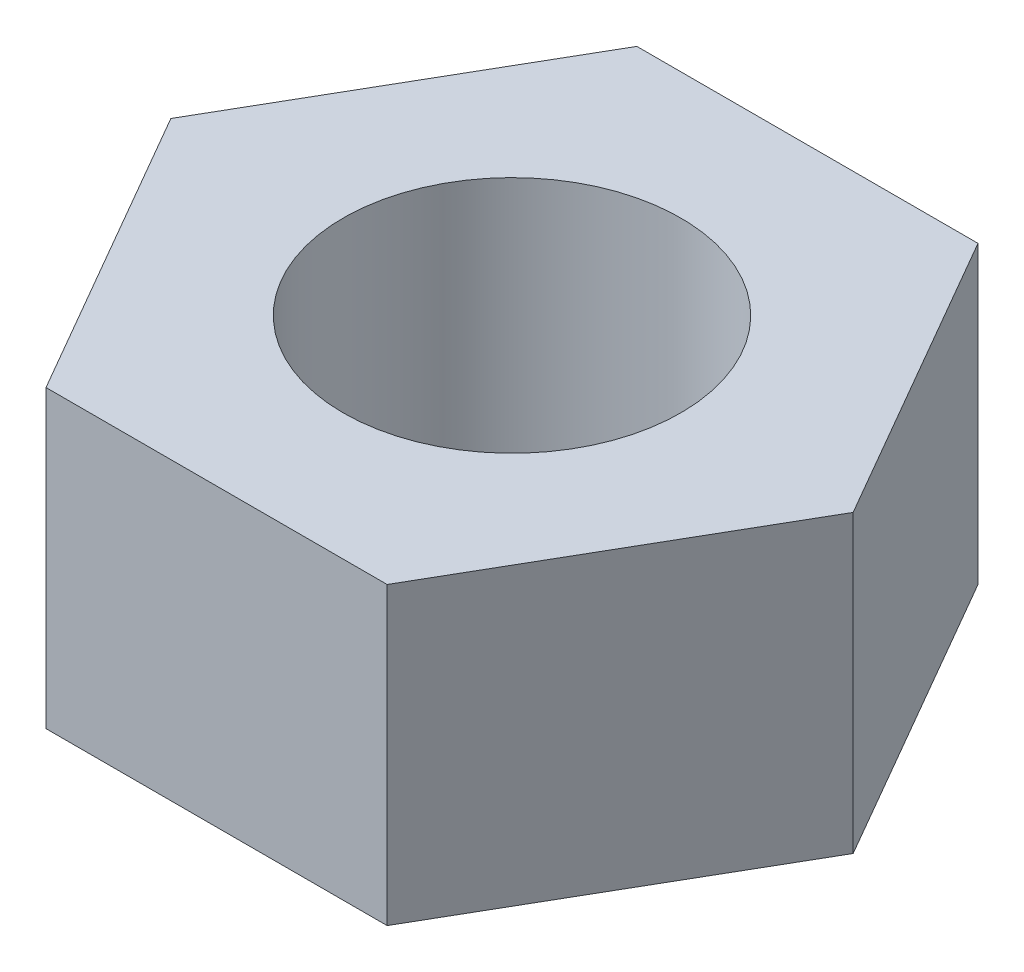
ISO-10303-21;
HEADER;
FILE_DESCRIPTION(('STEP AP214'),'2;1');
FILE_NAME('part.step','',(''),(''),'','','');
FILE_SCHEMA(('AUTOMOTIVE_DESIGN { 1 0 10303 214 1 1 1 1 }'));
ENDSEC;
DATA;
#1=APPLICATION_CONTEXT('core data for automotive mechanical design processes');
#2=APPLICATION_PROTOCOL_DEFINITION('international standard','automotive_design',2000,#1);
#3=PRODUCT_CONTEXT('',#1,'mechanical');
#4=PRODUCT('Part','Part','',(#3));
#5=PRODUCT_RELATED_PRODUCT_CATEGORY('part','',(#4));
#6=PRODUCT_DEFINITION_FORMATION('','',#4);
#7=PRODUCT_DEFINITION_CONTEXT('part definition',#1,'design');
#8=PRODUCT_DEFINITION('design','',#6,#7);
#9=PRODUCT_DEFINITION_SHAPE('','',#8);
#10=(LENGTH_UNIT() NAMED_UNIT(*) SI_UNIT(.MILLI.,.METRE.));
#11=(NAMED_UNIT(*) PLANE_ANGLE_UNIT() SI_UNIT($,.RADIAN.));
#12=(NAMED_UNIT(*) SI_UNIT($,.STERADIAN.) SOLID_ANGLE_UNIT());
#13=UNCERTAINTY_MEASURE_WITH_UNIT(LENGTH_MEASURE(1.E-05),#10,'distance_accuracy_value','');
#14=(GEOMETRIC_REPRESENTATION_CONTEXT(3) GLOBAL_UNCERTAINTY_ASSIGNED_CONTEXT((#13)) GLOBAL_UNIT_ASSIGNED_CONTEXT((#10,
#11,#12)) REPRESENTATION_CONTEXT('',''));
#15=CARTESIAN_POINT('',(0.,0.,0.));
#16=DIRECTION('',(0.,0.,1.));
#17=DIRECTION('',(1.,0.,0.));
#18=AXIS2_PLACEMENT_3D('',#15,#16,#17);
#19=CARTESIAN_POINT('',(0.,2.778125,0.));
#20=DIRECTION('',(0.,1.,0.));
#21=DIRECTION('',(0.,0.,1.));
#22=AXIS2_PLACEMENT_3D('',#19,#20,#21);
#23=PLANE('',#22);
#24=DIRECTION('',(0.5,0.,-0.866025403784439));
#25=VECTOR('',#24,1.);
#26=CARTESIAN_POINT('',(3.20790243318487,2.778125,5.55625000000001));
#27=LINE('',#26,#25);
#28=CARTESIAN_POINT('',(3.20790243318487,2.778125,5.55625000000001));
#29=VERTEX_POINT('',#28);
#30=CARTESIAN_POINT('',(6.41580486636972,2.778125,0.));
#31=VERTEX_POINT('',#30);
#32=EDGE_CURVE('E129',#29,#31,#27,.T.);
#33=ORIENTED_EDGE('',*,*,#32,.T.);
#34=DIRECTION('',(-0.5,0.,-0.866025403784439));
#35=VECTOR('',#34,1.);
#36=CARTESIAN_POINT('',(6.41580486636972,2.778125,0.));
#37=LINE('',#36,#35);
#38=CARTESIAN_POINT('',(3.20790243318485,2.778125,-5.55625000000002));
#39=VERTEX_POINT('',#38);
#40=EDGE_CURVE('E87',#31,#39,#37,.T.);
#41=ORIENTED_EDGE('',*,*,#40,.T.);
#42=DIRECTION('',(-1.,0.,0.));
#43=VECTOR('',#42,1.);
#44=CARTESIAN_POINT('',(3.20790243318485,2.778125,-5.55625000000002));
#45=LINE('',#44,#43);
#46=CARTESIAN_POINT('',(-3.20790243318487,2.778125,-5.55625000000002));
#47=VERTEX_POINT('',#46);
#48=EDGE_CURVE('E100',#39,#47,#45,.T.);
#49=ORIENTED_EDGE('',*,*,#48,.T.);
#50=DIRECTION('',(-0.5,0.,0.866025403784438));
#51=VECTOR('',#50,1.);
#52=CARTESIAN_POINT('',(-3.20790243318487,2.778125,-5.55625000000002));
#53=LINE('',#52,#51);
#54=CARTESIAN_POINT('',(-6.41580486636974,2.778125,0.));
#55=VERTEX_POINT('',#54);
#56=EDGE_CURVE('E94',#47,#55,#53,.T.);
#57=ORIENTED_EDGE('',*,*,#56,.T.);
#58=DIRECTION('',(0.5,0.,0.866025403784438));
#59=VECTOR('',#58,1.);
#60=CARTESIAN_POINT('',(-6.41580486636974,2.778125,0.));
#61=LINE('',#60,#59);
#62=CARTESIAN_POINT('',(-3.20790243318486,2.778125,5.55625000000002));
#63=VERTEX_POINT('',#62);
#64=EDGE_CURVE('E98',#55,#63,#61,.T.);
#65=ORIENTED_EDGE('',*,*,#64,.T.);
#66=DIRECTION('',(1.,0.,0.));
#67=VECTOR('',#66,1.);
#68=CARTESIAN_POINT('',(-3.20790243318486,2.778125,5.55625000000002));
#69=LINE('',#68,#67);
#70=EDGE_CURVE('E50',#63,#29,#69,.T.);
#71=ORIENTED_EDGE('',*,*,#70,.T.);
#72=EDGE_LOOP('',(#33,#41,#49,#57,#65,#71));
#73=FACE_BOUND('',#72,.T.);
#74=CARTESIAN_POINT('',(0.,2.778125,0.));
#75=DIRECTION('',(0.,1.,0.));
#76=DIRECTION('',(0.,0.,1.));
#77=AXIS2_PLACEMENT_3D('',#74,#75,#76);
#78=CIRCLE('',#77,3.175);
#79=CARTESIAN_POINT('',(0.,2.778125,3.175));
#80=VERTEX_POINT('',#79);
#81=EDGE_CURVE('E122',#80,#80,#78,.T.);
#82=ORIENTED_EDGE('',*,*,#81,.F.);
#83=EDGE_LOOP('',(#82));
#84=FACE_BOUND('',#83,.T.);
#85=ADVANCED_FACE('F33',(#73,#84),#23,.T.);
#86=CARTESIAN_POINT('',(0.,-2.778125,0.));
#87=DIRECTION('',(0.,1.,0.));
#88=DIRECTION('',(0.,0.,1.));
#89=AXIS2_PLACEMENT_3D('',#86,#87,#88);
#90=PLANE('',#89);
#91=DIRECTION('',(0.5,0.,-0.866025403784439));
#92=VECTOR('',#91,1.);
#93=CARTESIAN_POINT('',(3.20790243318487,-2.778125,5.55625000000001));
#94=LINE('',#93,#92);
#95=CARTESIAN_POINT('',(3.20790243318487,-2.778125,5.55625000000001));
#96=VERTEX_POINT('',#95);
#97=CARTESIAN_POINT('',(6.41580486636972,-2.778125,0.));
#98=VERTEX_POINT('',#97);
#99=EDGE_CURVE('E118',#96,#98,#94,.T.);
#100=ORIENTED_EDGE('',*,*,#99,.F.);
#101=DIRECTION('',(1.,0.,0.));
#102=VECTOR('',#101,1.);
#103=CARTESIAN_POINT('',(-3.20790243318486,-2.778125,5.55625000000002));
#104=LINE('',#103,#102);
#105=CARTESIAN_POINT('',(-3.20790243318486,-2.778125,5.55625000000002));
#106=VERTEX_POINT('',#105);
#107=EDGE_CURVE('E79',#106,#96,#104,.T.);
#108=ORIENTED_EDGE('',*,*,#107,.F.);
#109=DIRECTION('',(0.5,0.,0.866025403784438));
#110=VECTOR('',#109,1.);
#111=CARTESIAN_POINT('',(-6.41580486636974,-2.778125,0.));
#112=LINE('',#111,#110);
#113=CARTESIAN_POINT('',(-6.41580486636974,-2.778125,0.));
#114=VERTEX_POINT('',#113);
#115=EDGE_CURVE('E73',#114,#106,#112,.T.);
#116=ORIENTED_EDGE('',*,*,#115,.F.);
#117=DIRECTION('',(-0.5,0.,0.866025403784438));
#118=VECTOR('',#117,1.);
#119=CARTESIAN_POINT('',(-3.20790243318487,-2.778125,-5.55625000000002));
#120=LINE('',#119,#118);
#121=CARTESIAN_POINT('',(-3.20790243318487,-2.778125,-5.55625000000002));
#122=VERTEX_POINT('',#121);
#123=EDGE_CURVE('E108',#122,#114,#120,.T.);
#124=ORIENTED_EDGE('',*,*,#123,.F.);
#125=DIRECTION('',(-1.,0.,0.));
#126=VECTOR('',#125,1.);
#127=CARTESIAN_POINT('',(3.20790243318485,-2.778125,-5.55625000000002));
#128=LINE('',#127,#126);
#129=CARTESIAN_POINT('',(3.20790243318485,-2.778125,-5.55625000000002));
#130=VERTEX_POINT('',#129);
#131=EDGE_CURVE('E124',#130,#122,#128,.T.);
#132=ORIENTED_EDGE('',*,*,#131,.F.);
#133=DIRECTION('',(-0.5,0.,-0.866025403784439));
#134=VECTOR('',#133,1.);
#135=CARTESIAN_POINT('',(6.41580486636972,-2.778125,0.));
#136=LINE('',#135,#134);
#137=EDGE_CURVE('E121',#98,#130,#136,.T.);
#138=ORIENTED_EDGE('',*,*,#137,.F.);
#139=EDGE_LOOP('',(#100,#108,#116,#124,#132,#138));
#140=FACE_BOUND('',#139,.T.);
#141=CARTESIAN_POINT('',(0.,-2.778125,0.));
#142=DIRECTION('',(0.,1.,0.));
#143=DIRECTION('',(0.,0.,1.));
#144=AXIS2_PLACEMENT_3D('',#141,#142,#143);
#145=CIRCLE('',#144,3.175);
#146=CARTESIAN_POINT('',(0.,-2.778125,3.175));
#147=VERTEX_POINT('',#146);
#148=EDGE_CURVE('E222',#147,#147,#145,.T.);
#149=ORIENTED_EDGE('',*,*,#148,.T.);
#150=EDGE_LOOP('',(#149));
#151=FACE_BOUND('',#150,.T.);
#152=ADVANCED_FACE('F138',(#140,#151),#90,.F.);
#153=CARTESIAN_POINT('',(3.20790243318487,2.778125,5.55625000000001));
#154=DIRECTION('',(-0.866025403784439,0.,-0.5));
#155=DIRECTION('',(-0.5,0.,0.866025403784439));
#156=AXIS2_PLACEMENT_3D('',#153,#154,#155);
#157=PLANE('',#156);
#158=ORIENTED_EDGE('',*,*,#99,.T.);
#159=DIRECTION('',(0.,-1.,0.));
#160=VECTOR('',#159,1.);
#161=CARTESIAN_POINT('',(6.41580486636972,2.778125,0.));
#162=LINE('',#161,#160);
#163=EDGE_CURVE('E11',#31,#98,#162,.T.);
#164=ORIENTED_EDGE('',*,*,#163,.F.);
#165=ORIENTED_EDGE('',*,*,#32,.F.);
#166=DIRECTION('',(0.,-1.,0.));
#167=VECTOR('',#166,1.);
#168=CARTESIAN_POINT('',(3.20790243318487,2.778125,5.55625000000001));
#169=LINE('',#168,#167);
#170=EDGE_CURVE('E114',#29,#96,#169,.T.);
#171=ORIENTED_EDGE('',*,*,#170,.T.);
#172=EDGE_LOOP('',(#158,#164,#165,#171));
#173=FACE_BOUND('',#172,.T.);
#174=ADVANCED_FACE('F35',(#173),#157,.F.);
#175=CARTESIAN_POINT('',(6.41580486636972,2.778125,0.));
#176=DIRECTION('',(-0.866025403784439,0.,0.5));
#177=DIRECTION('',(0.5,0.,0.866025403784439));
#178=AXIS2_PLACEMENT_3D('',#175,#176,#177);
#179=PLANE('',#178);
#180=ORIENTED_EDGE('',*,*,#137,.T.);
#181=DIRECTION('',(0.,-1.,0.));
#182=VECTOR('',#181,1.);
#183=CARTESIAN_POINT('',(3.20790243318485,2.778125,-5.55625000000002));
#184=LINE('',#183,#182);
#185=EDGE_CURVE('E42',#39,#130,#184,.T.);
#186=ORIENTED_EDGE('',*,*,#185,.F.);
#187=ORIENTED_EDGE('',*,*,#40,.F.);
#188=ORIENTED_EDGE('',*,*,#163,.T.);
#189=EDGE_LOOP('',(#180,#186,#187,#188));
#190=FACE_BOUND('',#189,.T.);
#191=ADVANCED_FACE('F163',(#190),#179,.F.);
#192=CARTESIAN_POINT('',(3.20790243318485,2.778125,-5.55625000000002));
#193=DIRECTION('',(0.,0.,1.));
#194=DIRECTION('',(1.,0.,0.));
#195=AXIS2_PLACEMENT_3D('',#192,#193,#194);
#196=PLANE('',#195);
#197=ORIENTED_EDGE('',*,*,#131,.T.);
#198=DIRECTION('',(0.,-1.,0.));
#199=VECTOR('',#198,1.);
#200=CARTESIAN_POINT('',(-3.20790243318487,2.778125,-5.55625000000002));
#201=LINE('',#200,#199);
#202=EDGE_CURVE('E109',#47,#122,#201,.T.);
#203=ORIENTED_EDGE('',*,*,#202,.F.);
#204=ORIENTED_EDGE('',*,*,#48,.F.);
#205=ORIENTED_EDGE('',*,*,#185,.T.);
#206=EDGE_LOOP('',(#197,#203,#204,#205));
#207=FACE_BOUND('',#206,.T.);
#208=ADVANCED_FACE('F135',(#207),#196,.F.);
#209=CARTESIAN_POINT('',(-3.20790243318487,2.778125,-5.55625000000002));
#210=DIRECTION('',(0.866025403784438,0.,0.5));
#211=DIRECTION('',(0.5,0.,-0.866025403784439));
#212=AXIS2_PLACEMENT_3D('',#209,#210,#211);
#213=PLANE('',#212);
#214=ORIENTED_EDGE('',*,*,#123,.T.);
#215=DIRECTION('',(0.,-1.,0.));
#216=VECTOR('',#215,1.);
#217=CARTESIAN_POINT('',(-6.41580486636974,2.778125,0.));
#218=LINE('',#217,#216);
#219=EDGE_CURVE('E105',#55,#114,#218,.T.);
#220=ORIENTED_EDGE('',*,*,#219,.F.);
#221=ORIENTED_EDGE('',*,*,#56,.F.);
#222=ORIENTED_EDGE('',*,*,#202,.T.);
#223=EDGE_LOOP('',(#214,#220,#221,#222));
#224=FACE_BOUND('',#223,.T.);
#225=ADVANCED_FACE('F106',(#224),#213,.F.);
#226=CARTESIAN_POINT('',(-6.41580486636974,2.778125,0.));
#227=DIRECTION('',(0.866025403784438,0.,-0.5));
#228=DIRECTION('',(-0.5,0.,-0.866025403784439));
#229=AXIS2_PLACEMENT_3D('',#226,#227,#228);
#230=PLANE('',#229);
#231=ORIENTED_EDGE('',*,*,#115,.T.);
#232=DIRECTION('',(0.,-1.,0.));
#233=VECTOR('',#232,1.);
#234=CARTESIAN_POINT('',(-3.20790243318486,2.778125,5.55625000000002));
#235=LINE('',#234,#233);
#236=EDGE_CURVE('E110',#63,#106,#235,.T.);
#237=ORIENTED_EDGE('',*,*,#236,.F.);
#238=ORIENTED_EDGE('',*,*,#64,.F.);
#239=ORIENTED_EDGE('',*,*,#219,.T.);
#240=EDGE_LOOP('',(#231,#237,#238,#239));
#241=FACE_BOUND('',#240,.T.);
#242=ADVANCED_FACE('F112',(#241),#230,.F.);
#243=CARTESIAN_POINT('',(-3.20790243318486,2.778125,5.55625000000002));
#244=DIRECTION('',(0.,0.,-1.));
#245=DIRECTION('',(-1.,0.,0.));
#246=AXIS2_PLACEMENT_3D('',#243,#244,#245);
#247=PLANE('',#246);
#248=ORIENTED_EDGE('',*,*,#107,.T.);
#249=ORIENTED_EDGE('',*,*,#170,.F.);
#250=ORIENTED_EDGE('',*,*,#70,.F.);
#251=ORIENTED_EDGE('',*,*,#236,.T.);
#252=EDGE_LOOP('',(#248,#249,#250,#251));
#253=FACE_BOUND('',#252,.T.);
#254=ADVANCED_FACE('F143',(#253),#247,.F.);
#255=CARTESIAN_POINT('',(0.,2.778125,0.));
#256=DIRECTION('',(0.,-1.,0.));
#257=DIRECTION('',(0.,0.,-1.));
#258=AXIS2_PLACEMENT_3D('',#255,#256,#257);
#259=CYLINDRICAL_SURFACE('',#258,3.175);
#260=ORIENTED_EDGE('',*,*,#81,.T.);
#261=EDGE_LOOP('',(#260));
#262=FACE_BOUND('',#261,.T.);
#263=ORIENTED_EDGE('',*,*,#148,.F.);
#264=EDGE_LOOP('',(#263));
#265=FACE_BOUND('',#264,.T.);
#266=ADVANCED_FACE('F145',(#262,#265),#259,.F.);
#267=CLOSED_SHELL('',(#85,#152,#174,#191,#208,#225,#242,#254,#266));
#268=MANIFOLD_SOLID_BREP('B2',#267);
#269=ADVANCED_BREP_SHAPE_REPRESENTATION('',(#18,#268),#14);
#270=SHAPE_DEFINITION_REPRESENTATION(#9,#269);
ENDSEC;
END-ISO-10303-21;
